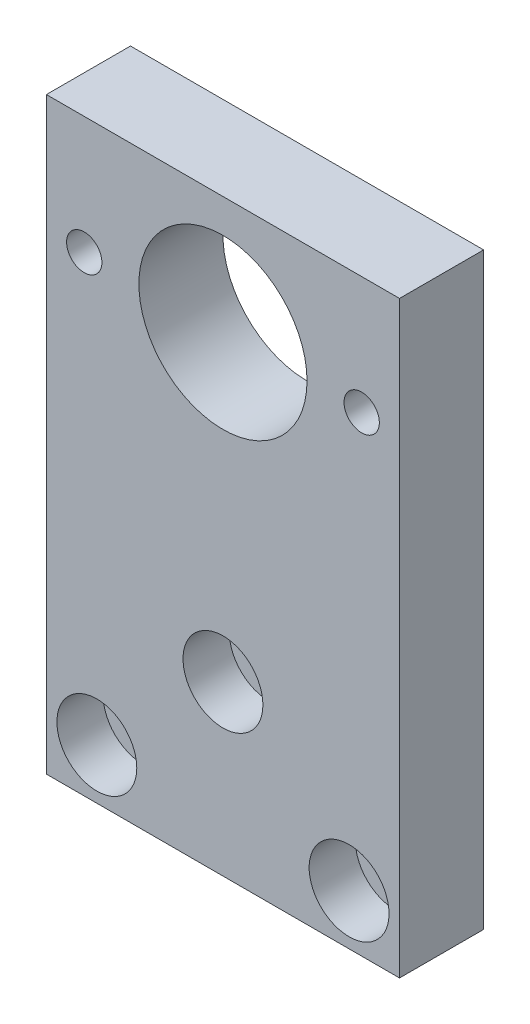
from build123d import *

# Parameters (mm, degrees)
SKETCH_1_W          = 42
SKETCH_1_H          = 70
SKETCH_1_R          = 2.75
SKETCH_1_R_2        = 2.1
SKETCH_1_R_3        = 10
EXTRUDE_1_DEPTH     = 10
SKETCH_2_R          = 4.75
CUT_EXTRUDE_1_DEPTH = 5.5


with BuildPart() as part:
    # Sketch 1 → Extrude 1 (new body)
    with BuildSketch(Plane.XY):
        with Locations((21, 35)):
            Rectangle(SKETCH_1_W, SKETCH_1_H)
        with Locations((6, 6)):
            Circle(SKETCH_1_R, mode=Mode.SUBTRACT)
        with Locations((36, 6)):
            Circle(SKETCH_1_R, mode=Mode.SUBTRACT)
        with Locations((21, 20)):
            Circle(SKETCH_1_R, mode=Mode.SUBTRACT)
        with Locations((4.5, 56)):
            Circle(SKETCH_1_R_2, mode=Mode.SUBTRACT)
        with Locations((37.5, 56)):
            Circle(SKETCH_1_R_2, mode=Mode.SUBTRACT)
        with Locations((21, 56)):
            Circle(SKETCH_1_R_3, mode=Mode.SUBTRACT)
    extrude(amount=EXTRUDE_1_DEPTH)

    # Sketch 2 → Cut-Extrude 1 (cut)
    with BuildSketch(Plane.XY.offset(10)):
        with Locations((6, 6)):
            Circle(SKETCH_2_R)
        with Locations((36, 6)):
            Circle(SKETCH_2_R)
        with Locations((21, 20)):
            Circle(SKETCH_2_R)
    extrude(amount=-CUT_EXTRUDE_1_DEPTH, mode=Mode.SUBTRACT)


solid = part.part
